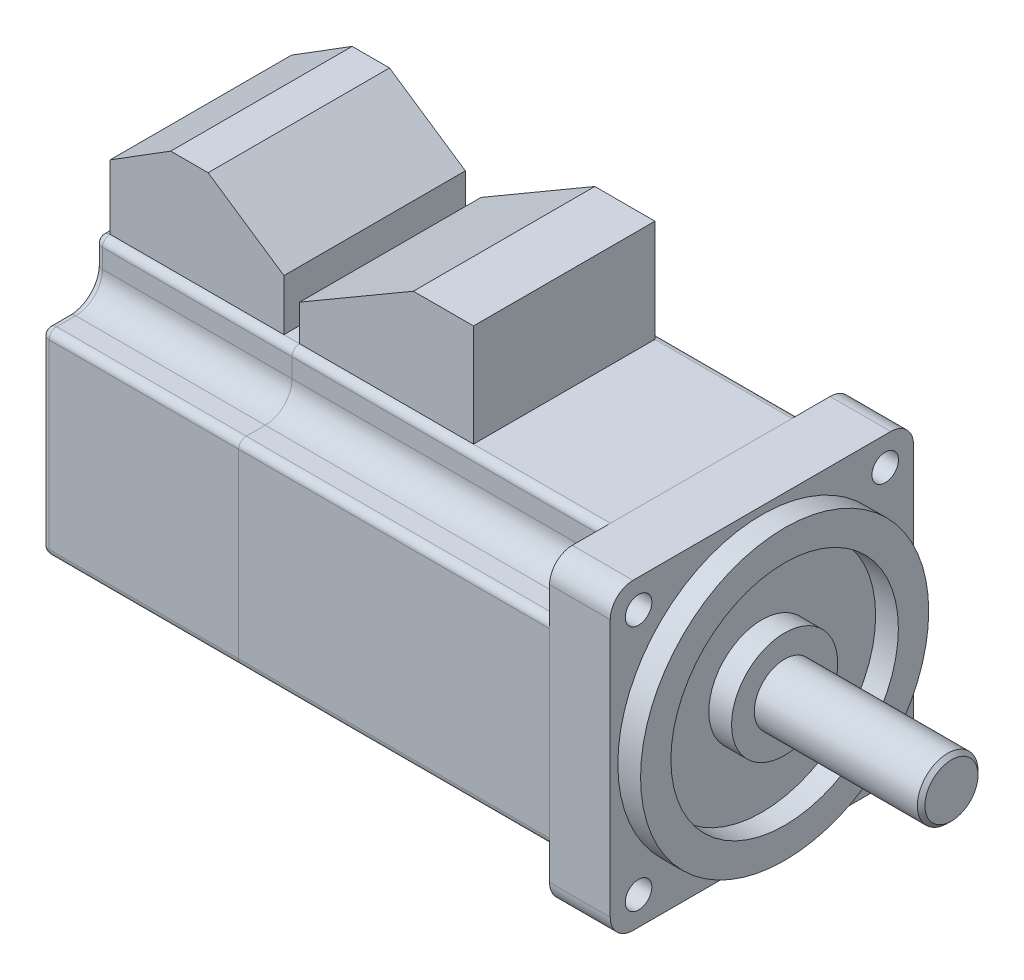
from build123d import *

# Parameters (mm, degrees)
EXTRUDE_1_DEPTH     = 26
EXTRUDE_2_DEPTH     = 41
EXTRUDE_3_DEPTH     = 8
CUT_EXTRUDE_1_DEPTH = 82
SKETCH_5_R          = 1.75
CUT_EXTRUDE_2_DEPTH = 8
FILLET_1_R          = 1
SKETCH_6_R          = 19
SKETCH_6_R_2        = 15
SKETCH_6_R_3        = 7
EXTRUDE_4_DEPTH     = 3
SKETCH_7_R          = 4
EXTRUDE_5_DEPTH     = 22
CHAMFER_1_SIZE      = 0.5
SKETCH_12_W         = 22.93
SKETCH_12_H         = 23.928932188
EXTRUDE_6_DEPTH     = 13.5
EXTRUDE_6_2_DEPTH   = 13.5
CUT_EXTRUDE_3_DEPTH = 23.93


with BuildPart() as part:
    # Sketch 1 → Extrude 1 (new body)
    with BuildSketch(Plane(origin=(0, 0, 0), x_dir=(0, 0, -1), z_dir=(1, 0, 0))):
        with BuildLine():
            Line((-17, -20), (17, -20))
            ThreePointArc((17, -20), (19.121320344, -19.121320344), (20, -17))
            Line((20, -17), (20, 17))
            ThreePointArc((20, 17), (19.121320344, 19.121320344), (17, 20))
            Line((17, 20), (-17, 20))
            ThreePointArc((-17, 20), (-19.121320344, 19.121320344), (-20, 17))
            Line((-20, 17), (-20, -17))
            ThreePointArc((-20, -17), (-19.121320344, -19.121320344), (-17, -20))
        make_face()
    extrude(amount=EXTRUDE_1_DEPTH)


with BuildPart() as body_2:
    # Sketch 2 → Extrude 2 (new body)
    with BuildSketch(Plane(origin=(26, 0, 0), x_dir=(0, 0, -1), z_dir=(1, 0, 0))):
        with BuildLine():
            Line((-17, -20), (17, -20))
            ThreePointArc((17, -20), (19.121320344, -19.121320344), (20, -17))
            Line((20, -17), (20, 17))
            ThreePointArc((20, 17), (19.121320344, 19.121320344), (17, 20))
            Line((17, 20), (-17, 20))
            ThreePointArc((-17, 20), (-19.121320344, 19.121320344), (-20, 17))
            Line((-20, 17), (-20, -17))
            ThreePointArc((-20, -17), (-19.121320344, -19.121320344), (-17, -20))
        make_face()
    extrude(amount=EXTRUDE_2_DEPTH)


with BuildPart() as body_3:
    # Sketch 3 → Extrude 3 (new body)
    with BuildSketch(Plane(origin=(67, 0, 0), x_dir=(0, 0, -1), z_dir=(1, 0, 0))):
        with BuildLine():
            Line((-17, -20), (17, -20))
            ThreePointArc((17, -20), (19.121320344, -19.121320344), (20, -17))
            Line((20, -17), (20, 17))
            ThreePointArc((20, 17), (19.121320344, 19.121320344), (17, 20))
            Line((17, 20), (-17, 20))
            ThreePointArc((-17, 20), (-19.121320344, 19.121320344), (-20, 17))
            Line((-20, 17), (-20, -17))
            ThreePointArc((-20, -17), (-19.121320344, -19.121320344), (-17, -20))
        make_face()
    extrude(amount=EXTRUDE_3_DEPTH)

    # Sketch 5 → Cut-Extrude 2 (cut)
    with BuildSketch(Plane(origin=(75, 0, 0), x_dir=(0, 0, -1), z_dir=(1, 0, 0))):
        with Locations((-16.263455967, 16.263455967)):
            Circle(SKETCH_5_R)
        with Locations((16.263455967, 16.263455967)):
            Circle(SKETCH_5_R)
        with Locations((16.263455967, -16.263455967)):
            Circle(SKETCH_5_R)
        with Locations((-16.263455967, -16.263455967)):
            Circle(SKETCH_5_R)
    extrude(amount=-CUT_EXTRUDE_2_DEPTH, mode=Mode.SUBTRACT)

    # Sketch 6 → Extrude 4 (add)
    # profile 1 of 2: a face of its own
    with BuildSketch(Plane(origin=(75, 0, 0), x_dir=(0, 0, -1), z_dir=(1, 0, 0))):
        with Locations(Location((0, 0, 0), (0, 0, 180))):
            Circle(SKETCH_6_R)
        Circle(SKETCH_6_R_2, mode=Mode.SUBTRACT)
    # profile 2 of 2: a face of its own
    with BuildSketch(Plane(origin=(75, 0, 0), x_dir=(0, 0, -1), z_dir=(1, 0, 0))):
        with Locations(Location((0, 0, 0), (0, 0, 180))):
            Circle(SKETCH_6_R_3)
    extrude(amount=EXTRUDE_4_DEPTH)


with BuildPart() as cut_extrude_1_tool:
    # Sketch 4 → Cut-Extrude 1 (new body)
    with BuildSketch(Plane.ZY):
        with BuildLine():
            Line((-16.5, 12.964466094), (-19, 12.964466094))
            ThreePointArc((-19, 12.964466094), (-19.707106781, 12.671572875), (-20, 11.964466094))
            Line((-20, 11.964466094), (-20, 17))
            ThreePointArc((-20, 17), (-19.121320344, 19.121320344), (-17, 20))
            Line((-17, 20), (-11.964466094, 20))
            ThreePointArc((-11.964466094, 20), (-12.671572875, 19.707106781), (-12.964466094, 19))
            Line((-12.964466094, 19), (-12.964466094, 16.5))
            ThreePointArc((-12.964466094, 16.5), (-14, 14), (-16.5, 12.964466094))
        make_face()
        with BuildLine():
            Line((11.964466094, 20), (17, 20))
            ThreePointArc((17, 20), (19.121320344, 19.121320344), (20, 17))
            Line((20, 17), (20, 11.964466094))
            ThreePointArc((20, 11.964466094), (19.707106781, 12.671572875), (19, 12.964466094))
            Line((19, 12.964466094), (16.5, 12.964466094))
            ThreePointArc((16.5, 12.964466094), (14, 14), (12.964466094, 16.5))
            Line((12.964466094, 16.5), (12.964466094, 19))
            ThreePointArc((12.964466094, 19), (12.671572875, 19.707106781), (11.964466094, 20))
        make_face()
        with BuildLine():
            Line((20, -11.964466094), (20, -17))
            ThreePointArc((20, -17), (19.121320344, -19.121320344), (17, -20))
            Line((17, -20), (11.964466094, -20))
            ThreePointArc((11.964466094, -20), (12.671572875, -19.707106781), (12.964466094, -19))
            Line((12.964466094, -19), (12.964466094, -16.5))
            ThreePointArc((12.964466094, -16.5), (14, -14), (16.5, -12.964466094))
            Line((16.5, -12.964466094), (19, -12.964466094))
            ThreePointArc((19, -12.964466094), (19.707106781, -12.671572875), (20, -11.964466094))
        make_face()
        with BuildLine():
            Line((-19, -12.964466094), (-16.5, -12.964466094))
            ThreePointArc((-16.5, -12.964466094), (-14, -14), (-12.964466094, -16.5))
            Line((-12.964466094, -16.5), (-12.964466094, -19))
            ThreePointArc((-12.964466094, -19), (-12.671572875, -19.707106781), (-11.964466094, -20))
            Line((-11.964466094, -20), (-17, -20))
            ThreePointArc((-17, -20), (-19.121320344, -19.121320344), (-20, -17))
            Line((-20, -17), (-20, -11.964466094))
            ThreePointArc((-20, -11.964466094), (-19.707106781, -12.671572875), (-19, -12.964466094))
        make_face()
    extrude(amount=-CUT_EXTRUDE_1_DEPTH)


with BuildPart() as part_1:
    add(part.part)

    # Cut-Extrude 1: cut by cut_extrude_1_tool
    add(cut_extrude_1_tool.part, mode=Mode.SUBTRACT)

    # Fillet 1
    fillet_1_edges = [part_1.edges().sort_by_distance(p)[0] for p in [
        (0, 14, 14),
        (0, 12.964466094, 17.75),
        (0, 12.671572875, 19.707106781),
        (0, 19.707106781, 12.671572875),
        (0, 17.75, 12.964466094),
        (0, 20, 0),
        (0, 0, -20),
        (0, -20, 0),
        (0, 0, 20),
        (0, 19.707106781, -12.671572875),
        (0, 12.671572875, -19.707106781),
        (0, 12.964466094, -17.75),
        (0, 14, -14),
        (0, 17.75, -12.964466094),
        (0, -14, -14),
        (0, -12.964466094, -17.75),
        (0, -12.671572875, -19.707106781),
        (0, -19.707106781, -12.671572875),
        (0, -17.75, -12.964466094),
        (0, -14, 14),
        (0, -17.75, 12.964466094),
        (0, -19.707106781, 12.671572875),
        (0, -12.671572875, 19.707106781),
        (0, -12.964466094, 17.75),
    ]]
    fillet(fillet_1_edges, radius=FILLET_1_R)


with BuildPart() as body_2_1:
    add(body_2.part)

    # Cut-Extrude 1: cut by cut_extrude_1_tool
    add(cut_extrude_1_tool.part, mode=Mode.SUBTRACT)


with BuildPart() as body_4:
    # Sketch 7 → Extrude 5 (new body)
    with BuildSketch(Plane(origin=(78, 0, 0), x_dir=(0, 0, -1), z_dir=(1, 0, 0))):
        Circle(SKETCH_7_R)
    extrude(amount=EXTRUDE_5_DEPTH)

    # Chamfer 1
    chamfer_1_edges = [body_4.edges().sort_by_distance(p)[0] for p in [
        (100, 0, 4),
    ]]
    chamfer(chamfer_1_edges, length=CHAMFER_1_SIZE)


with BuildPart() as body_5:
    # Sketch 12 → Extrude 6 (new body)
    with BuildSketch(Plane(origin=(0, 20, 0), x_dir=(1, 0, 0), z_dir=(0, 1, 0))):
        with Locations((37.465, 0)):
            Rectangle(SKETCH_12_W, SKETCH_12_H)
    extrude(amount=EXTRUDE_6_DEPTH)


with BuildPart() as body_6:
    # Sketch 12 → Extrude 6 2 (new body)
    with BuildSketch(Plane(origin=(0, 20, 0), x_dir=(1, 0, 0), z_dir=(0, 1, 0))):
        with Locations((12.465, 0)):
            Rectangle(SKETCH_12_W, SKETCH_12_H)
    extrude(amount=EXTRUDE_6_2_DEPTH)


with BuildPart() as cut_extrude_3_tool:
    # Sketch 13 → Cut-Extrude 3 (new body)
    with BuildSketch(Plane.XY.offset(11.964466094)):
        Polygon((1, 33.5), (1, 28.5), (9, 33.5), align=None)
        Polygon((23.93, 33.5), (13.93, 33.5), (23.93, 26.75), align=None)
        Polygon((26, 33.5), (41, 33.5), (26, 24.750823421), align=None)
    extrude(amount=-CUT_EXTRUDE_3_DEPTH)


with BuildPart() as body_5_1:
    add(body_5.part)

    # Cut-Extrude 3: cut by cut_extrude_3_tool
    add(cut_extrude_3_tool.part, mode=Mode.SUBTRACT)


with BuildPart() as body_6_1:
    add(body_6.part)

    # Cut-Extrude 3: cut by cut_extrude_3_tool
    add(cut_extrude_3_tool.part, mode=Mode.SUBTRACT)


solid = Compound([body_3.part, part_1.part, body_2_1.part, body_4.part, body_5_1.part, body_6_1.part])
